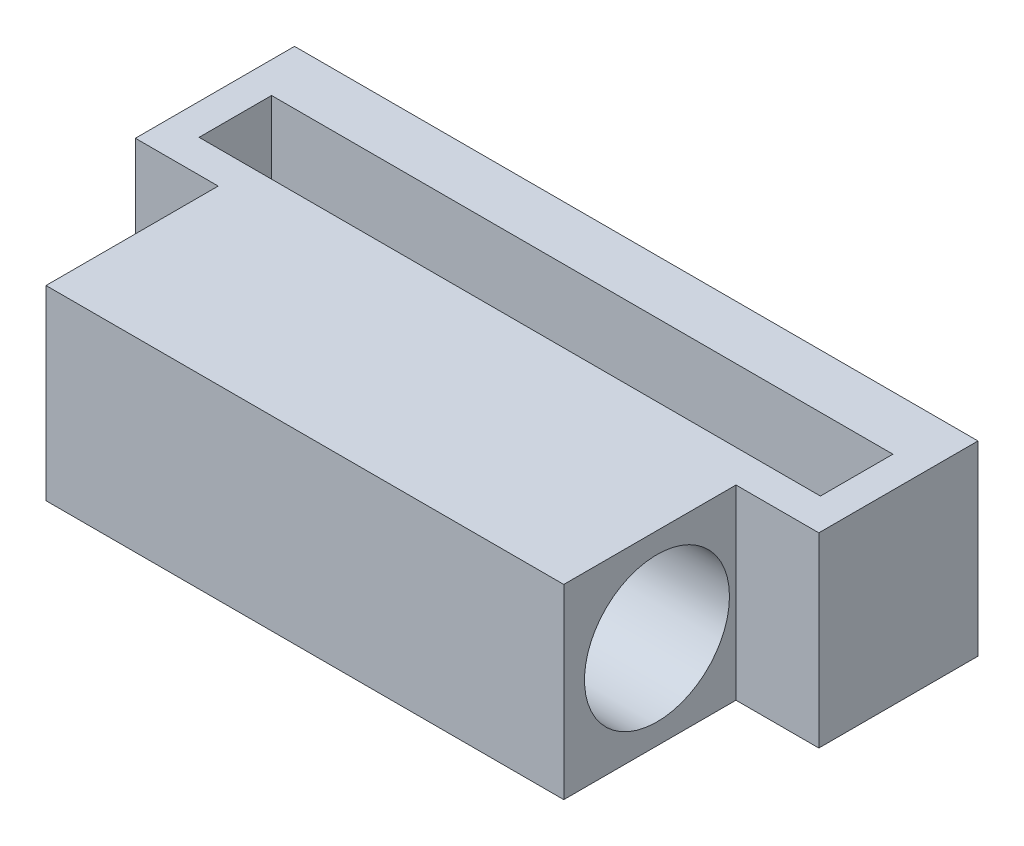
ISO-10303-21;
HEADER;
FILE_DESCRIPTION(('STEP AP214'),'2;1');
FILE_NAME('part.step','',(''),(''),'','','');
FILE_SCHEMA(('AUTOMOTIVE_DESIGN { 1 0 10303 214 1 1 1 1 }'));
ENDSEC;
DATA;
#1=APPLICATION_CONTEXT('core data for automotive mechanical design processes');
#2=APPLICATION_PROTOCOL_DEFINITION('international standard','automotive_design',2000,#1);
#3=PRODUCT_CONTEXT('',#1,'mechanical');
#4=PRODUCT('Part','Part','',(#3));
#5=PRODUCT_RELATED_PRODUCT_CATEGORY('part','',(#4));
#6=PRODUCT_DEFINITION_FORMATION('','',#4);
#7=PRODUCT_DEFINITION_CONTEXT('part definition',#1,'design');
#8=PRODUCT_DEFINITION('design','',#6,#7);
#9=PRODUCT_DEFINITION_SHAPE('','',#8);
#10=(LENGTH_UNIT() NAMED_UNIT(*) SI_UNIT(.MILLI.,.METRE.));
#11=(NAMED_UNIT(*) PLANE_ANGLE_UNIT() SI_UNIT($,.RADIAN.));
#12=(NAMED_UNIT(*) SI_UNIT($,.STERADIAN.) SOLID_ANGLE_UNIT());
#13=UNCERTAINTY_MEASURE_WITH_UNIT(LENGTH_MEASURE(1.E-05),#10,'distance_accuracy_value','');
#14=(GEOMETRIC_REPRESENTATION_CONTEXT(3) GLOBAL_UNCERTAINTY_ASSIGNED_CONTEXT((#13)) GLOBAL_UNIT_ASSIGNED_CONTEXT((#10,
#11,#12)) REPRESENTATION_CONTEXT('',''));
#15=CARTESIAN_POINT('',(0.,0.,0.));
#16=DIRECTION('',(0.,0.,1.));
#17=DIRECTION('',(1.,0.,0.));
#18=AXIS2_PLACEMENT_3D('',#15,#16,#17);
#19=CARTESIAN_POINT('',(0.,9.,0.));
#20=DIRECTION('',(1.,0.,0.));
#21=DIRECTION('',(0.,0.,-1.));
#22=AXIS2_PLACEMENT_3D('',#19,#20,#21);
#23=PLANE('',#22);
#24=CARTESIAN_POINT('',(0.,4.5,-4.5));
#25=DIRECTION('',(1.,0.,0.));
#26=DIRECTION('',(0.,0.,-1.));
#27=AXIS2_PLACEMENT_3D('',#24,#25,#26);
#28=CIRCLE('',#27,3.5);
#29=CARTESIAN_POINT('',(0.,4.5,-8.));
#30=VERTEX_POINT('',#29);
#31=EDGE_CURVE('E195',#30,#30,#28,.T.);
#32=ORIENTED_EDGE('',*,*,#31,.T.);
#33=EDGE_LOOP('',(#32));
#34=FACE_BOUND('',#33,.T.);
#35=DIRECTION('',(0.,0.,1.));
#36=VECTOR('',#35,1.);
#37=CARTESIAN_POINT('',(0.,9.,0.));
#38=LINE('',#37,#36);
#39=CARTESIAN_POINT('',(0.,9.,-8.31499990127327));
#40=VERTEX_POINT('',#39);
#41=CARTESIAN_POINT('',(0.,9.,0.));
#42=VERTEX_POINT('',#41);
#43=EDGE_CURVE('E201',#40,#42,#38,.T.);
#44=ORIENTED_EDGE('',*,*,#43,.F.);
#45=DIRECTION('',(0.,-1.,0.));
#46=VECTOR('',#45,1.);
#47=CARTESIAN_POINT('',(0.,9.,-8.31499990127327));
#48=LINE('',#47,#46);
#49=CARTESIAN_POINT('',(0.,0.,-8.31499990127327));
#50=VERTEX_POINT('',#49);
#51=EDGE_CURVE('E191',#40,#50,#48,.T.);
#52=ORIENTED_EDGE('',*,*,#51,.T.);
#53=DIRECTION('',(0.,0.,1.));
#54=VECTOR('',#53,1.);
#55=CARTESIAN_POINT('',(0.,0.,0.));
#56=LINE('',#55,#54);
#57=CARTESIAN_POINT('',(0.,0.,0.));
#58=VERTEX_POINT('',#57);
#59=EDGE_CURVE('E198',#50,#58,#56,.T.);
#60=ORIENTED_EDGE('',*,*,#59,.T.);
#61=DIRECTION('',(0.,-1.,0.));
#62=VECTOR('',#61,1.);
#63=CARTESIAN_POINT('',(0.,9.,0.));
#64=LINE('',#63,#62);
#65=EDGE_CURVE('E11',#42,#58,#64,.T.);
#66=ORIENTED_EDGE('',*,*,#65,.F.);
#67=EDGE_LOOP('',(#44,#52,#60,#66));
#68=FACE_BOUND('',#67,.T.);
#69=ADVANCED_FACE('F33',(#34,#68),#23,.F.);
#70=CARTESIAN_POINT('',(0.,9.,0.));
#71=DIRECTION('',(0.,0.,-1.));
#72=DIRECTION('',(-1.,0.,0.));
#73=AXIS2_PLACEMENT_3D('',#70,#71,#72);
#74=PLANE('',#73);
#75=DIRECTION('',(1.,0.,0.));
#76=VECTOR('',#75,1.);
#77=CARTESIAN_POINT('',(0.,0.,0.));
#78=LINE('',#77,#76);
#79=CARTESIAN_POINT('',(25.,0.,0.));
#80=VERTEX_POINT('',#79);
#81=EDGE_CURVE('E212',#58,#80,#78,.T.);
#82=ORIENTED_EDGE('',*,*,#81,.T.);
#83=DIRECTION('',(0.,-1.,0.));
#84=VECTOR('',#83,1.);
#85=CARTESIAN_POINT('',(25.,9.,0.));
#86=LINE('',#85,#84);
#87=CARTESIAN_POINT('',(25.,9.,0.));
#88=VERTEX_POINT('',#87);
#89=EDGE_CURVE('E40',#88,#80,#86,.T.);
#90=ORIENTED_EDGE('',*,*,#89,.F.);
#91=DIRECTION('',(1.,0.,0.));
#92=VECTOR('',#91,1.);
#93=CARTESIAN_POINT('',(0.,9.,0.));
#94=LINE('',#93,#92);
#95=EDGE_CURVE('E203',#42,#88,#94,.T.);
#96=ORIENTED_EDGE('',*,*,#95,.F.);
#97=ORIENTED_EDGE('',*,*,#65,.T.);
#98=EDGE_LOOP('',(#82,#90,#96,#97));
#99=FACE_BOUND('',#98,.T.);
#100=ADVANCED_FACE('F236',(#99),#74,.F.);
#101=CARTESIAN_POINT('',(25.,9.,0.));
#102=DIRECTION('',(-1.,0.,0.));
#103=DIRECTION('',(0.,0.,1.));
#104=AXIS2_PLACEMENT_3D('',#101,#102,#103);
#105=PLANE('',#104);
#106=CARTESIAN_POINT('',(25.,4.5,-4.5));
#107=DIRECTION('',(1.,0.,0.));
#108=DIRECTION('',(0.,0.,-1.));
#109=AXIS2_PLACEMENT_3D('',#106,#107,#108);
#110=CIRCLE('',#109,3.5);
#111=CARTESIAN_POINT('',(25.,4.5,-8.));
#112=VERTEX_POINT('',#111);
#113=EDGE_CURVE('E194',#112,#112,#110,.T.);
#114=ORIENTED_EDGE('',*,*,#113,.F.);
#115=EDGE_LOOP('',(#114));
#116=FACE_BOUND('',#115,.T.);
#117=DIRECTION('',(0.,0.,-1.));
#118=VECTOR('',#117,1.);
#119=CARTESIAN_POINT('',(25.,0.,0.));
#120=LINE('',#119,#118);
#121=CARTESIAN_POINT('',(25.,0.,-8.31499990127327));
#122=VERTEX_POINT('',#121);
#123=EDGE_CURVE('E214',#80,#122,#120,.T.);
#124=ORIENTED_EDGE('',*,*,#123,.T.);
#125=DIRECTION('',(0.,1.,0.));
#126=VECTOR('',#125,1.);
#127=CARTESIAN_POINT('',(25.,9.,-8.31499990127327));
#128=LINE('',#127,#126);
#129=CARTESIAN_POINT('',(25.,9.,-8.31499990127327));
#130=VERTEX_POINT('',#129);
#131=EDGE_CURVE('E185',#122,#130,#128,.T.);
#132=ORIENTED_EDGE('',*,*,#131,.T.);
#133=DIRECTION('',(0.,0.,-1.));
#134=VECTOR('',#133,1.);
#135=CARTESIAN_POINT('',(25.,9.,0.));
#136=LINE('',#135,#134);
#137=EDGE_CURVE('E206',#88,#130,#136,.T.);
#138=ORIENTED_EDGE('',*,*,#137,.F.);
#139=ORIENTED_EDGE('',*,*,#89,.T.);
#140=EDGE_LOOP('',(#124,#132,#138,#139));
#141=FACE_BOUND('',#140,.T.);
#142=ADVANCED_FACE('F221',(#116,#141),#105,.F.);
#143=CARTESIAN_POINT('',(0.,9.,-16.));
#144=DIRECTION('',(0.,0.,1.));
#145=DIRECTION('',(1.,0.,0.));
#146=AXIS2_PLACEMENT_3D('',#143,#144,#145);
#147=PLANE('',#146);
#148=DIRECTION('',(-1.,0.,0.));
#149=VECTOR('',#148,1.);
#150=CARTESIAN_POINT('',(0.,0.,-16.));
#151=LINE('',#150,#149);
#152=CARTESIAN_POINT('',(29.,0.,-16.));
#153=VERTEX_POINT('',#152);
#154=CARTESIAN_POINT('',(-4.,0.,-16.));
#155=VERTEX_POINT('',#154);
#156=EDGE_CURVE('E204',#153,#155,#151,.T.);
#157=ORIENTED_EDGE('',*,*,#156,.T.);
#158=DIRECTION('',(0.,1.,0.));
#159=VECTOR('',#158,1.);
#160=CARTESIAN_POINT('',(-4.,9.,-16.));
#161=LINE('',#160,#159);
#162=CARTESIAN_POINT('',(-4.,9.,-16.));
#163=VERTEX_POINT('',#162);
#164=EDGE_CURVE('E175',#155,#163,#161,.T.);
#165=ORIENTED_EDGE('',*,*,#164,.T.);
#166=DIRECTION('',(-1.,0.,0.));
#167=VECTOR('',#166,1.);
#168=CARTESIAN_POINT('',(0.,9.,-16.));
#169=LINE('',#168,#167);
#170=CARTESIAN_POINT('',(29.,9.,-16.));
#171=VERTEX_POINT('',#170);
#172=EDGE_CURVE('E209',#171,#163,#169,.T.);
#173=ORIENTED_EDGE('',*,*,#172,.F.);
#174=DIRECTION('',(0.,1.,0.));
#175=VECTOR('',#174,1.);
#176=CARTESIAN_POINT('',(29.,9.,-16.));
#177=LINE('',#176,#175);
#178=EDGE_CURVE('E163',#153,#171,#177,.T.);
#179=ORIENTED_EDGE('',*,*,#178,.F.);
#180=EDGE_LOOP('',(#157,#165,#173,#179));
#181=FACE_BOUND('',#180,.T.);
#182=ADVANCED_FACE('F249',(#181),#147,.F.);
#183=CARTESIAN_POINT('',(0.,9.,0.));
#184=DIRECTION('',(0.,-1.,0.));
#185=DIRECTION('',(0.,0.,-1.));
#186=AXIS2_PLACEMENT_3D('',#183,#184,#185);
#187=PLANE('',#186);
#188=DIRECTION('',(1.,0.,0.));
#189=VECTOR('',#188,1.);
#190=CARTESIAN_POINT('',(-2.5,9.,-9.89084720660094));
#191=LINE('',#190,#189);
#192=CARTESIAN_POINT('',(-2.5,9.,-9.89084720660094));
#193=VERTEX_POINT('',#192);
#194=CARTESIAN_POINT('',(27.5,9.,-9.89084720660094));
#195=VERTEX_POINT('',#194);
#196=EDGE_CURVE('E148',#193,#195,#191,.T.);
#197=ORIENTED_EDGE('',*,*,#196,.F.);
#198=DIRECTION('',(0.,0.,1.));
#199=VECTOR('',#198,1.);
#200=CARTESIAN_POINT('',(-2.5,9.,-13.3908472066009));
#201=LINE('',#200,#199);
#202=CARTESIAN_POINT('',(-2.5,9.,-13.3908472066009));
#203=VERTEX_POINT('',#202);
#204=EDGE_CURVE('E47',#203,#193,#201,.T.);
#205=ORIENTED_EDGE('',*,*,#204,.F.);
#206=DIRECTION('',(-1.,0.,0.));
#207=VECTOR('',#206,1.);
#208=CARTESIAN_POINT('',(-2.5,9.,-13.3908472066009));
#209=LINE('',#208,#207);
#210=CARTESIAN_POINT('',(27.5,9.,-13.3908472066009));
#211=VERTEX_POINT('',#210);
#212=EDGE_CURVE('E139',#211,#203,#209,.T.);
#213=ORIENTED_EDGE('',*,*,#212,.F.);
#214=DIRECTION('',(0.,0.,-1.));
#215=VECTOR('',#214,1.);
#216=CARTESIAN_POINT('',(27.5,9.,-13.3908472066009));
#217=LINE('',#216,#215);
#218=EDGE_CURVE('E142',#195,#211,#217,.T.);
#219=ORIENTED_EDGE('',*,*,#218,.F.);
#220=EDGE_LOOP('',(#197,#205,#213,#219));
#221=FACE_BOUND('',#220,.T.);
#222=ORIENTED_EDGE('',*,*,#137,.T.);
#223=DIRECTION('',(1.,0.,0.));
#224=VECTOR('',#223,1.);
#225=CARTESIAN_POINT('',(-4.,9.,-8.31499990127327));
#226=LINE('',#225,#224);
#227=CARTESIAN_POINT('',(29.,9.,-8.31499990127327));
#228=VERTEX_POINT('',#227);
#229=EDGE_CURVE('E186',#130,#228,#226,.T.);
#230=ORIENTED_EDGE('',*,*,#229,.T.);
#231=DIRECTION('',(0.,0.,1.));
#232=VECTOR('',#231,1.);
#233=CARTESIAN_POINT('',(29.,9.,-8.31499990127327));
#234=LINE('',#233,#232);
#235=EDGE_CURVE('E166',#171,#228,#234,.T.);
#236=ORIENTED_EDGE('',*,*,#235,.F.);
#237=ORIENTED_EDGE('',*,*,#172,.T.);
#238=DIRECTION('',(0.,0.,1.));
#239=VECTOR('',#238,1.);
#240=CARTESIAN_POINT('',(-4.,9.,-8.31499990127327));
#241=LINE('',#240,#239);
#242=CARTESIAN_POINT('',(-4.,9.,-8.31499990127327));
#243=VERTEX_POINT('',#242);
#244=EDGE_CURVE('E178',#163,#243,#241,.T.);
#245=ORIENTED_EDGE('',*,*,#244,.T.);
#246=EDGE_CURVE('E182',#243,#40,#226,.T.);
#247=ORIENTED_EDGE('',*,*,#246,.T.);
#248=ORIENTED_EDGE('',*,*,#43,.T.);
#249=ORIENTED_EDGE('',*,*,#95,.T.);
#250=EDGE_LOOP('',(#222,#230,#236,#237,#245,#247,#248,#249));
#251=FACE_BOUND('',#250,.T.);
#252=ADVANCED_FACE('F233',(#221,#251),#187,.F.);
#253=CARTESIAN_POINT('',(0.,0.,0.));
#254=DIRECTION('',(0.,-1.,0.));
#255=DIRECTION('',(0.,0.,-1.));
#256=AXIS2_PLACEMENT_3D('',#253,#254,#255);
#257=PLANE('',#256);
#258=DIRECTION('',(0.,0.,1.));
#259=VECTOR('',#258,1.);
#260=CARTESIAN_POINT('',(-2.5,0.,-13.3908472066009));
#261=LINE('',#260,#259);
#262=CARTESIAN_POINT('',(-2.5,0.,-13.3908472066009));
#263=VERTEX_POINT('',#262);
#264=CARTESIAN_POINT('',(-2.5,0.,-9.89084720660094));
#265=VERTEX_POINT('',#264);
#266=EDGE_CURVE('E123',#263,#265,#261,.T.);
#267=ORIENTED_EDGE('',*,*,#266,.T.);
#268=DIRECTION('',(1.,0.,0.));
#269=VECTOR('',#268,1.);
#270=CARTESIAN_POINT('',(-2.5,0.,-9.89084720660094));
#271=LINE('',#270,#269);
#272=CARTESIAN_POINT('',(27.5,0.,-9.89084720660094));
#273=VERTEX_POINT('',#272);
#274=EDGE_CURVE('E132',#265,#273,#271,.T.);
#275=ORIENTED_EDGE('',*,*,#274,.T.);
#276=DIRECTION('',(0.,0.,-1.));
#277=VECTOR('',#276,1.);
#278=CARTESIAN_POINT('',(27.5,0.,-13.3908472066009));
#279=LINE('',#278,#277);
#280=CARTESIAN_POINT('',(27.5,0.,-13.3908472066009));
#281=VERTEX_POINT('',#280);
#282=EDGE_CURVE('E55',#273,#281,#279,.T.);
#283=ORIENTED_EDGE('',*,*,#282,.T.);
#284=DIRECTION('',(-1.,0.,0.));
#285=VECTOR('',#284,1.);
#286=CARTESIAN_POINT('',(-2.5,0.,-13.3908472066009));
#287=LINE('',#286,#285);
#288=EDGE_CURVE('E129',#281,#263,#287,.T.);
#289=ORIENTED_EDGE('',*,*,#288,.T.);
#290=EDGE_LOOP('',(#267,#275,#283,#289));
#291=FACE_BOUND('',#290,.T.);
#292=ORIENTED_EDGE('',*,*,#59,.F.);
#293=DIRECTION('',(1.,0.,0.));
#294=VECTOR('',#293,1.);
#295=CARTESIAN_POINT('',(-4.,0.,-8.31499990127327));
#296=LINE('',#295,#294);
#297=CARTESIAN_POINT('',(-4.,0.,-8.31499990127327));
#298=VERTEX_POINT('',#297);
#299=EDGE_CURVE('E187',#298,#50,#296,.T.);
#300=ORIENTED_EDGE('',*,*,#299,.F.);
#301=DIRECTION('',(0.,0.,-1.));
#302=VECTOR('',#301,1.);
#303=CARTESIAN_POINT('',(-4.,0.,-8.31499990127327));
#304=LINE('',#303,#302);
#305=EDGE_CURVE('E172',#298,#155,#304,.T.);
#306=ORIENTED_EDGE('',*,*,#305,.T.);
#307=ORIENTED_EDGE('',*,*,#156,.F.);
#308=DIRECTION('',(0.,0.,-1.));
#309=VECTOR('',#308,1.);
#310=CARTESIAN_POINT('',(29.,0.,-8.31499990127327));
#311=LINE('',#310,#309);
#312=CARTESIAN_POINT('',(29.,0.,-8.31499990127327));
#313=VERTEX_POINT('',#312);
#314=EDGE_CURVE('E160',#313,#153,#311,.T.);
#315=ORIENTED_EDGE('',*,*,#314,.F.);
#316=EDGE_CURVE('E181',#122,#313,#296,.T.);
#317=ORIENTED_EDGE('',*,*,#316,.F.);
#318=ORIENTED_EDGE('',*,*,#123,.F.);
#319=ORIENTED_EDGE('',*,*,#81,.F.);
#320=EDGE_LOOP('',(#292,#300,#306,#307,#315,#317,#318,#319));
#321=FACE_BOUND('',#320,.T.);
#322=ADVANCED_FACE('F136',(#291,#321),#257,.T.);
#323=CARTESIAN_POINT('',(0.,4.5,-4.5));
#324=DIRECTION('',(1.,0.,0.));
#325=DIRECTION('',(0.,0.,-1.));
#326=AXIS2_PLACEMENT_3D('',#323,#324,#325);
#327=CYLINDRICAL_SURFACE('',#326,3.5);
#328=ORIENTED_EDGE('',*,*,#31,.F.);
#329=EDGE_LOOP('',(#328));
#330=FACE_BOUND('',#329,.T.);
#331=ORIENTED_EDGE('',*,*,#113,.T.);
#332=EDGE_LOOP('',(#331));
#333=FACE_BOUND('',#332,.T.);
#334=ADVANCED_FACE('F253',(#330,#333),#327,.F.);
#335=CARTESIAN_POINT('',(29.,0.,0.));
#336=DIRECTION('',(1.,0.,0.));
#337=DIRECTION('',(0.,0.,-1.));
#338=AXIS2_PLACEMENT_3D('',#335,#336,#337);
#339=PLANE('',#338);
#340=DIRECTION('',(0.,-1.,0.));
#341=VECTOR('',#340,1.);
#342=CARTESIAN_POINT('',(29.,9.,-8.31499990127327));
#343=LINE('',#342,#341);
#344=EDGE_CURVE('E154',#228,#313,#343,.T.);
#345=ORIENTED_EDGE('',*,*,#344,.T.);
#346=ORIENTED_EDGE('',*,*,#314,.T.);
#347=ORIENTED_EDGE('',*,*,#178,.T.);
#348=ORIENTED_EDGE('',*,*,#235,.T.);
#349=EDGE_LOOP('',(#345,#346,#347,#348));
#350=FACE_BOUND('',#349,.T.);
#351=ADVANCED_FACE('F251',(#350),#339,.T.);
#352=CARTESIAN_POINT('',(-4.,9.,-8.31499990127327));
#353=DIRECTION('',(0.,0.,1.));
#354=DIRECTION('',(1.,0.,0.));
#355=AXIS2_PLACEMENT_3D('',#352,#353,#354);
#356=PLANE('',#355);
#357=ORIENTED_EDGE('',*,*,#131,.F.);
#358=ORIENTED_EDGE('',*,*,#316,.T.);
#359=ORIENTED_EDGE('',*,*,#344,.F.);
#360=ORIENTED_EDGE('',*,*,#229,.F.);
#361=EDGE_LOOP('',(#357,#358,#359,#360));
#362=FACE_BOUND('',#361,.T.);
#363=ADVANCED_FACE('F230',(#362),#356,.T.);
#364=ORIENTED_EDGE('',*,*,#51,.F.);
#365=ORIENTED_EDGE('',*,*,#246,.F.);
#366=DIRECTION('',(0.,-1.,0.));
#367=VECTOR('',#366,1.);
#368=CARTESIAN_POINT('',(-4.,9.,-8.31499990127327));
#369=LINE('',#368,#367);
#370=EDGE_CURVE('E169',#243,#298,#369,.T.);
#371=ORIENTED_EDGE('',*,*,#370,.T.);
#372=ORIENTED_EDGE('',*,*,#299,.T.);
#373=EDGE_LOOP('',(#364,#365,#371,#372));
#374=FACE_BOUND('',#373,.T.);
#375=ADVANCED_FACE('F246',(#374),#356,.T.);
#376=CARTESIAN_POINT('',(-4.,0.,0.));
#377=DIRECTION('',(1.,0.,0.));
#378=DIRECTION('',(0.,0.,-1.));
#379=AXIS2_PLACEMENT_3D('',#376,#377,#378);
#380=PLANE('',#379);
#381=ORIENTED_EDGE('',*,*,#370,.F.);
#382=ORIENTED_EDGE('',*,*,#244,.F.);
#383=ORIENTED_EDGE('',*,*,#164,.F.);
#384=ORIENTED_EDGE('',*,*,#305,.F.);
#385=EDGE_LOOP('',(#381,#382,#383,#384));
#386=FACE_BOUND('',#385,.T.);
#387=ADVANCED_FACE('F244',(#386),#380,.F.);
#388=CARTESIAN_POINT('',(-2.5,0.,-13.3908472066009));
#389=DIRECTION('',(-1.,0.,0.));
#390=DIRECTION('',(0.,0.,1.));
#391=AXIS2_PLACEMENT_3D('',#388,#389,#390);
#392=PLANE('',#391);
#393=ORIENTED_EDGE('',*,*,#204,.T.);
#394=DIRECTION('',(0.,1.,0.));
#395=VECTOR('',#394,1.);
#396=CARTESIAN_POINT('',(-2.5,0.,-9.89084720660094));
#397=LINE('',#396,#395);
#398=EDGE_CURVE('E119',#265,#193,#397,.T.);
#399=ORIENTED_EDGE('',*,*,#398,.F.);
#400=ORIENTED_EDGE('',*,*,#266,.F.);
#401=DIRECTION('',(0.,1.,0.));
#402=VECTOR('',#401,1.);
#403=CARTESIAN_POINT('',(-2.5,0.,-13.3908472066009));
#404=LINE('',#403,#402);
#405=EDGE_CURVE('E152',#263,#203,#404,.T.);
#406=ORIENTED_EDGE('',*,*,#405,.T.);
#407=EDGE_LOOP('',(#393,#399,#400,#406));
#408=FACE_BOUND('',#407,.T.);
#409=ADVANCED_FACE('F121',(#408),#392,.F.);
#410=CARTESIAN_POINT('',(-2.5,0.,-13.3908472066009));
#411=DIRECTION('',(0.,0.,-1.));
#412=DIRECTION('',(-1.,0.,0.));
#413=AXIS2_PLACEMENT_3D('',#410,#411,#412);
#414=PLANE('',#413);
#415=ORIENTED_EDGE('',*,*,#212,.T.);
#416=ORIENTED_EDGE('',*,*,#405,.F.);
#417=ORIENTED_EDGE('',*,*,#288,.F.);
#418=DIRECTION('',(0.,1.,0.));
#419=VECTOR('',#418,1.);
#420=CARTESIAN_POINT('',(27.5,0.,-13.3908472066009));
#421=LINE('',#420,#419);
#422=EDGE_CURVE('E155',#281,#211,#421,.T.);
#423=ORIENTED_EDGE('',*,*,#422,.T.);
#424=EDGE_LOOP('',(#415,#416,#417,#423));
#425=FACE_BOUND('',#424,.T.);
#426=ADVANCED_FACE('F289',(#425),#414,.F.);
#427=CARTESIAN_POINT('',(27.5,0.,-13.3908472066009));
#428=DIRECTION('',(1.,0.,0.));
#429=DIRECTION('',(0.,0.,-1.));
#430=AXIS2_PLACEMENT_3D('',#427,#428,#429);
#431=PLANE('',#430);
#432=ORIENTED_EDGE('',*,*,#218,.T.);
#433=ORIENTED_EDGE('',*,*,#422,.F.);
#434=ORIENTED_EDGE('',*,*,#282,.F.);
#435=DIRECTION('',(0.,1.,0.));
#436=VECTOR('',#435,1.);
#437=CARTESIAN_POINT('',(27.5,0.,-9.89084720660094));
#438=LINE('',#437,#436);
#439=EDGE_CURVE('E128',#273,#195,#438,.T.);
#440=ORIENTED_EDGE('',*,*,#439,.T.);
#441=EDGE_LOOP('',(#432,#433,#434,#440));
#442=FACE_BOUND('',#441,.T.);
#443=ADVANCED_FACE('F293',(#442),#431,.F.);
#444=CARTESIAN_POINT('',(-2.5,0.,-9.89084720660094));
#445=DIRECTION('',(0.,0.,1.));
#446=DIRECTION('',(1.,0.,0.));
#447=AXIS2_PLACEMENT_3D('',#444,#445,#446);
#448=PLANE('',#447);
#449=ORIENTED_EDGE('',*,*,#196,.T.);
#450=ORIENTED_EDGE('',*,*,#439,.F.);
#451=ORIENTED_EDGE('',*,*,#274,.F.);
#452=ORIENTED_EDGE('',*,*,#398,.T.);
#453=EDGE_LOOP('',(#449,#450,#451,#452));
#454=FACE_BOUND('',#453,.T.);
#455=ADVANCED_FACE('F133',(#454),#448,.F.);
#456=CLOSED_SHELL('',(#69,#100,#142,#182,#252,#322,#334,#351,#363,#375,#387,#409,#426,#443,#455));
#457=MANIFOLD_SOLID_BREP('B2',#456);
#458=ADVANCED_BREP_SHAPE_REPRESENTATION('',(#18,#457),#14);
#459=SHAPE_DEFINITION_REPRESENTATION(#9,#458);
ENDSEC;
END-ISO-10303-21;
